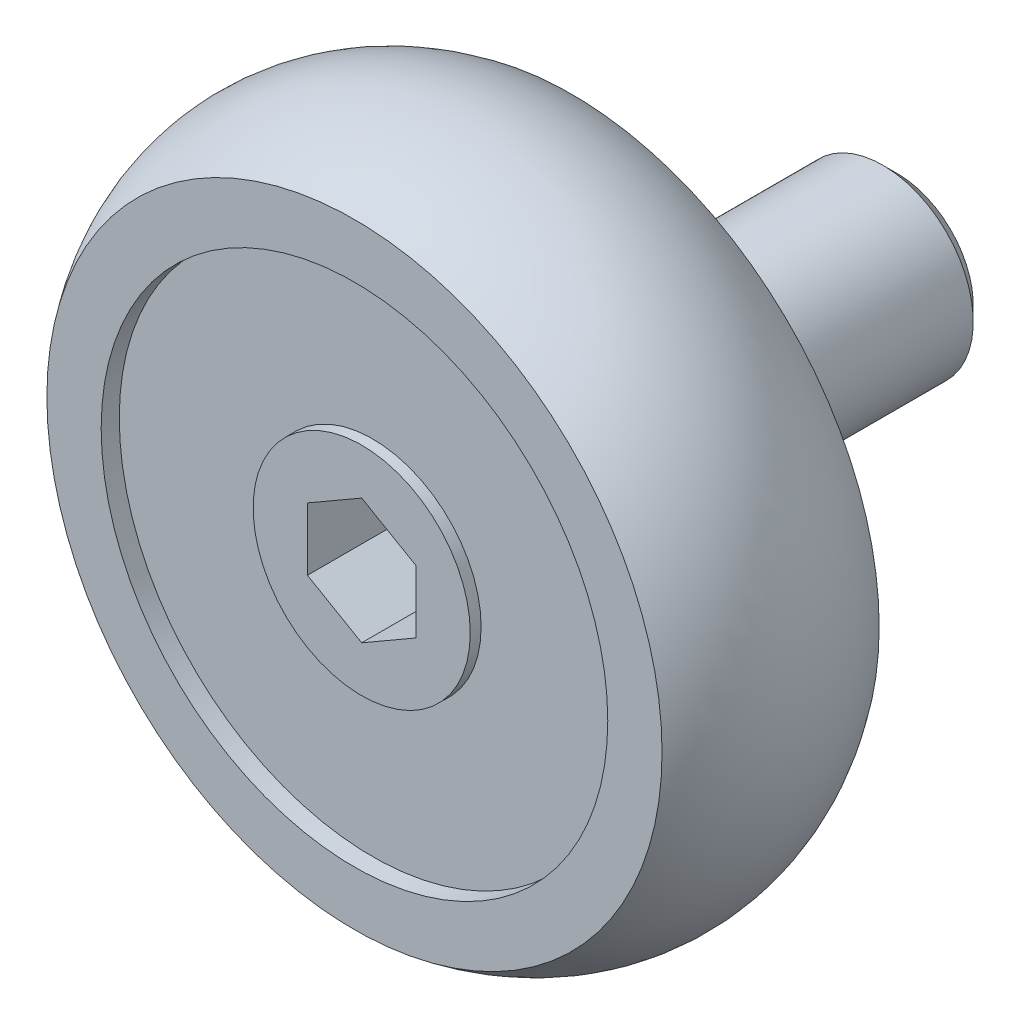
ISO-10303-21;
HEADER;
FILE_DESCRIPTION(('STEP AP214'),'2;1');
FILE_NAME('part.step','',(''),(''),'','','');
FILE_SCHEMA(('AUTOMOTIVE_DESIGN { 1 0 10303 214 1 1 1 1 }'));
ENDSEC;
DATA;
#1=APPLICATION_CONTEXT('core data for automotive mechanical design processes');
#2=APPLICATION_PROTOCOL_DEFINITION('international standard','automotive_design',2000,#1);
#3=PRODUCT_CONTEXT('',#1,'mechanical');
#4=PRODUCT('Part','Part','',(#3));
#5=PRODUCT_RELATED_PRODUCT_CATEGORY('part','',(#4));
#6=PRODUCT_DEFINITION_FORMATION('','',#4);
#7=PRODUCT_DEFINITION_CONTEXT('part definition',#1,'design');
#8=PRODUCT_DEFINITION('design','',#6,#7);
#9=PRODUCT_DEFINITION_SHAPE('','',#8);
#10=(LENGTH_UNIT() NAMED_UNIT(*) SI_UNIT(.MILLI.,.METRE.));
#11=(NAMED_UNIT(*) PLANE_ANGLE_UNIT() SI_UNIT($,.RADIAN.));
#12=(NAMED_UNIT(*) SI_UNIT($,.STERADIAN.) SOLID_ANGLE_UNIT());
#13=UNCERTAINTY_MEASURE_WITH_UNIT(LENGTH_MEASURE(1.E-05),#10,'distance_accuracy_value','');
#14=(GEOMETRIC_REPRESENTATION_CONTEXT(3) GLOBAL_UNCERTAINTY_ASSIGNED_CONTEXT((#13)) GLOBAL_UNIT_ASSIGNED_CONTEXT((#10,
#11,#12)) REPRESENTATION_CONTEXT('',''));
#15=CARTESIAN_POINT('',(0.,0.,0.));
#16=DIRECTION('',(0.,0.,1.));
#17=DIRECTION('',(1.,0.,0.));
#18=AXIS2_PLACEMENT_3D('',#15,#16,#17);
#19=CARTESIAN_POINT('',(0.,3.99999999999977,0.));
#20=DIRECTION('',(0.,0.,1.));
#21=DIRECTION('',(1.,0.,0.));
#22=AXIS2_PLACEMENT_3D('',#19,#20,#21);
#23=PLANE('',#22);
#24=CARTESIAN_POINT('',(0.,0.,0.));
#25=DIRECTION('',(0.,0.,1.));
#26=DIRECTION('',(1.,0.,0.));
#27=AXIS2_PLACEMENT_3D('',#24,#25,#26);
#28=CIRCLE('',#27,3.99999999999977);
#29=CARTESIAN_POINT('',(3.99999999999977,0.,0.));
#30=VERTEX_POINT('',#29);
#31=EDGE_CURVE('E9',#30,#30,#28,.T.);
#32=ORIENTED_EDGE('',*,*,#31,.F.);
#33=EDGE_LOOP('',(#32));
#34=FACE_BOUND('',#33,.T.);
#35=CARTESIAN_POINT('',(0.,0.,0.));
#36=DIRECTION('',(0.,0.,-1.));
#37=DIRECTION('',(-1.,0.,0.));
#38=AXIS2_PLACEMENT_3D('',#35,#36,#37);
#39=CIRCLE('',#38,2.);
#40=CARTESIAN_POINT('',(-2.,0.,0.));
#41=VERTEX_POINT('',#40);
#42=EDGE_CURVE('E104',#41,#41,#39,.T.);
#43=ORIENTED_EDGE('',*,*,#42,.F.);
#44=EDGE_LOOP('',(#43));
#45=FACE_BOUND('',#44,.T.);
#46=ADVANCED_FACE('F14',(#34,#45),#23,.F.);
#47=CARTESIAN_POINT('',(0.,0.,10.));
#48=DIRECTION('',(0.,0.,1.));
#49=DIRECTION('',(1.,0.,0.));
#50=AXIS2_PLACEMENT_3D('',#47,#48,#49);
#51=CYLINDRICAL_SURFACE('',#50,3.99999999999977);
#52=CARTESIAN_POINT('',(0.,0.,1.5));
#53=DIRECTION('',(0.,0.,1.));
#54=DIRECTION('',(1.,0.,0.));
#55=AXIS2_PLACEMENT_3D('',#52,#53,#54);
#56=CIRCLE('',#55,3.99999999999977);
#57=CARTESIAN_POINT('',(3.99999999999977,0.,1.5));
#58=VERTEX_POINT('',#57);
#59=EDGE_CURVE('E22',#58,#58,#56,.T.);
#60=ORIENTED_EDGE('',*,*,#59,.F.);
#61=EDGE_LOOP('',(#60));
#62=FACE_BOUND('',#61,.T.);
#63=ORIENTED_EDGE('',*,*,#31,.T.);
#64=EDGE_LOOP('',(#63));
#65=FACE_BOUND('',#64,.T.);
#66=ADVANCED_FACE('F150',(#62,#65),#51,.T.);
#67=CARTESIAN_POINT('',(0.,3.99999999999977,1.5));
#68=DIRECTION('',(0.,0.,1.));
#69=DIRECTION('',(1.,0.,0.));
#70=AXIS2_PLACEMENT_3D('',#67,#68,#69);
#71=PLANE('',#70);
#72=CARTESIAN_POINT('',(0.,0.,1.5));
#73=DIRECTION('',(0.,0.,1.));
#74=DIRECTION('',(1.,0.,0.));
#75=AXIS2_PLACEMENT_3D('',#72,#73,#74);
#76=CIRCLE('',#75,7.);
#77=CARTESIAN_POINT('',(7.,0.,1.5));
#78=VERTEX_POINT('',#77);
#79=EDGE_CURVE('E143',#78,#78,#76,.T.);
#80=ORIENTED_EDGE('',*,*,#79,.F.);
#81=EDGE_LOOP('',(#80));
#82=FACE_BOUND('',#81,.T.);
#83=ORIENTED_EDGE('',*,*,#59,.T.);
#84=EDGE_LOOP('',(#83));
#85=FACE_BOUND('',#84,.T.);
#86=ADVANCED_FACE('F148',(#82,#85),#71,.F.);
#87=CARTESIAN_POINT('',(0.,0.,10.));
#88=DIRECTION('',(0.,0.,1.));
#89=DIRECTION('',(1.,0.,0.));
#90=AXIS2_PLACEMENT_3D('',#87,#88,#89);
#91=CYLINDRICAL_SURFACE('',#90,7.);
#92=CARTESIAN_POINT('',(0.,0.,1.));
#93=DIRECTION('',(0.,0.,1.));
#94=DIRECTION('',(1.,0.,0.));
#95=AXIS2_PLACEMENT_3D('',#92,#93,#94);
#96=CIRCLE('',#95,7.);
#97=CARTESIAN_POINT('',(7.,0.,1.));
#98=VERTEX_POINT('',#97);
#99=EDGE_CURVE('E140',#98,#98,#96,.T.);
#100=ORIENTED_EDGE('',*,*,#99,.F.);
#101=EDGE_LOOP('',(#100));
#102=FACE_BOUND('',#101,.T.);
#103=ORIENTED_EDGE('',*,*,#79,.T.);
#104=EDGE_LOOP('',(#103));
#105=FACE_BOUND('',#104,.T.);
#106=ADVANCED_FACE('F223',(#102,#105),#91,.F.);
#107=CARTESIAN_POINT('',(0.,8.5,1.));
#108=DIRECTION('',(0.,0.,1.));
#109=DIRECTION('',(1.,0.,0.));
#110=AXIS2_PLACEMENT_3D('',#107,#108,#109);
#111=PLANE('',#110);
#112=CARTESIAN_POINT('',(0.,0.,1.));
#113=DIRECTION('',(0.,0.,1.));
#114=DIRECTION('',(1.,0.,0.));
#115=AXIS2_PLACEMENT_3D('',#112,#113,#114);
#116=CIRCLE('',#115,8.5);
#117=CARTESIAN_POINT('',(8.5,0.,1.));
#118=VERTEX_POINT('',#117);
#119=EDGE_CURVE('E137',#118,#118,#116,.T.);
#120=ORIENTED_EDGE('',*,*,#119,.F.);
#121=EDGE_LOOP('',(#120));
#122=FACE_BOUND('',#121,.T.);
#123=ORIENTED_EDGE('',*,*,#99,.T.);
#124=EDGE_LOOP('',(#123));
#125=FACE_BOUND('',#124,.T.);
#126=ADVANCED_FACE('F219',(#122,#125),#111,.F.);
#127=CARTESIAN_POINT('',(0.,0.,4.));
#128=DIRECTION('',(0.,0.,1.));
#129=DIRECTION('',(1.,0.,0.));
#130=AXIS2_PLACEMENT_3D('',#127,#128,#129);
#131=DEGENERATE_TOROIDAL_SURFACE('',#130,4.5,5.,.T.);
#132=CARTESIAN_POINT('',(0.,0.,7.));
#133=DIRECTION('',(0.,0.,1.));
#134=DIRECTION('',(1.,0.,0.));
#135=AXIS2_PLACEMENT_3D('',#132,#133,#134);
#136=CIRCLE('',#135,8.5);
#137=CARTESIAN_POINT('',(8.5,0.,7.));
#138=VERTEX_POINT('',#137);
#139=EDGE_CURVE('E134',#138,#138,#136,.T.);
#140=ORIENTED_EDGE('',*,*,#139,.F.);
#141=EDGE_LOOP('',(#140));
#142=FACE_BOUND('',#141,.T.);
#143=ORIENTED_EDGE('',*,*,#119,.T.);
#144=EDGE_LOOP('',(#143));
#145=FACE_BOUND('',#144,.T.);
#146=ADVANCED_FACE('F215',(#142,#145),#131,.T.);
#147=CARTESIAN_POINT('',(0.,8.5,7.));
#148=DIRECTION('',(0.,0.,-1.));
#149=DIRECTION('',(-1.,0.,0.));
#150=AXIS2_PLACEMENT_3D('',#147,#148,#149);
#151=PLANE('',#150);
#152=CARTESIAN_POINT('',(0.,0.,7.));
#153=DIRECTION('',(0.,0.,1.));
#154=DIRECTION('',(1.,0.,0.));
#155=AXIS2_PLACEMENT_3D('',#152,#153,#154);
#156=CIRCLE('',#155,7.);
#157=CARTESIAN_POINT('',(7.,0.,7.));
#158=VERTEX_POINT('',#157);
#159=EDGE_CURVE('E131',#158,#158,#156,.T.);
#160=ORIENTED_EDGE('',*,*,#159,.F.);
#161=EDGE_LOOP('',(#160));
#162=FACE_BOUND('',#161,.T.);
#163=ORIENTED_EDGE('',*,*,#139,.T.);
#164=EDGE_LOOP('',(#163));
#165=FACE_BOUND('',#164,.T.);
#166=ADVANCED_FACE('F211',(#162,#165),#151,.F.);
#167=CARTESIAN_POINT('',(0.,0.,10.));
#168=DIRECTION('',(0.,0.,1.));
#169=DIRECTION('',(1.,0.,0.));
#170=AXIS2_PLACEMENT_3D('',#167,#168,#169);
#171=CYLINDRICAL_SURFACE('',#170,7.);
#172=CARTESIAN_POINT('',(0.,0.,6.5));
#173=DIRECTION('',(0.,0.,1.));
#174=DIRECTION('',(1.,0.,0.));
#175=AXIS2_PLACEMENT_3D('',#172,#173,#174);
#176=CIRCLE('',#175,7.);
#177=CARTESIAN_POINT('',(7.,0.,6.5));
#178=VERTEX_POINT('',#177);
#179=EDGE_CURVE('E128',#178,#178,#176,.T.);
#180=ORIENTED_EDGE('',*,*,#179,.F.);
#181=EDGE_LOOP('',(#180));
#182=FACE_BOUND('',#181,.T.);
#183=ORIENTED_EDGE('',*,*,#159,.T.);
#184=EDGE_LOOP('',(#183));
#185=FACE_BOUND('',#184,.T.);
#186=ADVANCED_FACE('F207',(#182,#185),#171,.F.);
#187=CARTESIAN_POINT('',(0.,3.,6.5));
#188=DIRECTION('',(0.,0.,-1.));
#189=DIRECTION('',(-1.,0.,0.));
#190=AXIS2_PLACEMENT_3D('',#187,#188,#189);
#191=PLANE('',#190);
#192=CARTESIAN_POINT('',(0.,0.,6.5));
#193=DIRECTION('',(0.,0.,1.));
#194=DIRECTION('',(1.,0.,0.));
#195=AXIS2_PLACEMENT_3D('',#192,#193,#194);
#196=CIRCLE('',#195,3.);
#197=CARTESIAN_POINT('',(3.,0.,6.5));
#198=VERTEX_POINT('',#197);
#199=EDGE_CURVE('E125',#198,#198,#196,.T.);
#200=ORIENTED_EDGE('',*,*,#199,.F.);
#201=EDGE_LOOP('',(#200));
#202=FACE_BOUND('',#201,.T.);
#203=ORIENTED_EDGE('',*,*,#179,.T.);
#204=EDGE_LOOP('',(#203));
#205=FACE_BOUND('',#204,.T.);
#206=ADVANCED_FACE('F203',(#202,#205),#191,.F.);
#207=CARTESIAN_POINT('',(0.,0.,10.));
#208=DIRECTION('',(0.,0.,1.));
#209=DIRECTION('',(1.,0.,0.));
#210=AXIS2_PLACEMENT_3D('',#207,#208,#209);
#211=CYLINDRICAL_SURFACE('',#210,3.);
#212=CARTESIAN_POINT('',(0.,0.,6.8));
#213=DIRECTION('',(0.,0.,1.));
#214=DIRECTION('',(1.,0.,0.));
#215=AXIS2_PLACEMENT_3D('',#212,#213,#214);
#216=CIRCLE('',#215,3.);
#217=CARTESIAN_POINT('',(3.,0.,6.8));
#218=VERTEX_POINT('',#217);
#219=EDGE_CURVE('E117',#218,#218,#216,.T.);
#220=ORIENTED_EDGE('',*,*,#219,.F.);
#221=EDGE_LOOP('',(#220));
#222=FACE_BOUND('',#221,.T.);
#223=ORIENTED_EDGE('',*,*,#199,.T.);
#224=EDGE_LOOP('',(#223));
#225=FACE_BOUND('',#224,.T.);
#226=ADVANCED_FACE('F200',(#222,#225),#211,.T.);
#227=CARTESIAN_POINT('',(0.,3.,6.8));
#228=DIRECTION('',(0.,0.,-1.));
#229=DIRECTION('',(-1.,0.,0.));
#230=AXIS2_PLACEMENT_3D('',#227,#228,#229);
#231=PLANE('',#230);
#232=DIRECTION('',(-0.866025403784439,-0.5,0.));
#233=VECTOR('',#232,1.);
#234=CARTESIAN_POINT('',(0.,1.73205080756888,6.8));
#235=LINE('',#234,#233);
#236=CARTESIAN_POINT('',(0.,1.73205080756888,6.8));
#237=VERTEX_POINT('',#236);
#238=CARTESIAN_POINT('',(-1.5,0.866025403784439,6.8));
#239=VERTEX_POINT('',#238);
#240=EDGE_CURVE('E103',#237,#239,#235,.T.);
#241=ORIENTED_EDGE('',*,*,#240,.F.);
#242=DIRECTION('',(-0.866025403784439,0.5,0.));
#243=VECTOR('',#242,1.);
#244=CARTESIAN_POINT('',(1.5,0.86602540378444,6.8));
#245=LINE('',#244,#243);
#246=CARTESIAN_POINT('',(1.5,0.86602540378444,6.8));
#247=VERTEX_POINT('',#246);
#248=EDGE_CURVE('E29',#247,#237,#245,.T.);
#249=ORIENTED_EDGE('',*,*,#248,.F.);
#250=DIRECTION('',(0.,1.,0.));
#251=VECTOR('',#250,1.);
#252=CARTESIAN_POINT('',(1.5,-0.866025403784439,6.8));
#253=LINE('',#252,#251);
#254=CARTESIAN_POINT('',(1.5,-0.866025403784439,6.8));
#255=VERTEX_POINT('',#254);
#256=EDGE_CURVE('E113',#255,#247,#253,.T.);
#257=ORIENTED_EDGE('',*,*,#256,.F.);
#258=DIRECTION('',(0.866025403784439,0.5,0.));
#259=VECTOR('',#258,1.);
#260=CARTESIAN_POINT('',(0.,-1.73205080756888,6.8));
#261=LINE('',#260,#259);
#262=CARTESIAN_POINT('',(0.,-1.73205080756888,6.8));
#263=VERTEX_POINT('',#262);
#264=EDGE_CURVE('E111',#263,#255,#261,.T.);
#265=ORIENTED_EDGE('',*,*,#264,.F.);
#266=DIRECTION('',(0.866025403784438,-0.5,0.));
#267=VECTOR('',#266,1.);
#268=CARTESIAN_POINT('',(-1.5,-0.866025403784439,6.8));
#269=LINE('',#268,#267);
#270=CARTESIAN_POINT('',(-1.5,-0.866025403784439,6.8));
#271=VERTEX_POINT('',#270);
#272=EDGE_CURVE('E77',#271,#263,#269,.T.);
#273=ORIENTED_EDGE('',*,*,#272,.F.);
#274=DIRECTION('',(0.,-1.,0.));
#275=VECTOR('',#274,1.);
#276=CARTESIAN_POINT('',(-1.5,0.866025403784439,6.8));
#277=LINE('',#276,#275);
#278=EDGE_CURVE('E107',#239,#271,#277,.T.);
#279=ORIENTED_EDGE('',*,*,#278,.F.);
#280=EDGE_LOOP('',(#241,#249,#257,#265,#273,#279));
#281=FACE_BOUND('',#280,.T.);
#282=ORIENTED_EDGE('',*,*,#219,.T.);
#283=EDGE_LOOP('',(#282));
#284=FACE_BOUND('',#283,.T.);
#285=ADVANCED_FACE('F175',(#281,#284),#231,.F.);
#286=CARTESIAN_POINT('',(1.5,0.86602540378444,4.3));
#287=DIRECTION('',(0.5,0.866025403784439,0.));
#288=DIRECTION('',(-0.866025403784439,0.5,0.));
#289=AXIS2_PLACEMENT_3D('',#286,#287,#288);
#290=PLANE('',#289);
#291=ORIENTED_EDGE('',*,*,#248,.T.);
#292=DIRECTION('',(0.,0.,1.));
#293=VECTOR('',#292,1.);
#294=CARTESIAN_POINT('',(0.,1.73205080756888,4.3));
#295=LINE('',#294,#293);
#296=CARTESIAN_POINT('',(0.,1.73205080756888,4.3));
#297=VERTEX_POINT('',#296);
#298=EDGE_CURVE('E59',#297,#237,#295,.T.);
#299=ORIENTED_EDGE('',*,*,#298,.F.);
#300=DIRECTION('',(-0.866025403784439,0.5,0.));
#301=VECTOR('',#300,1.);
#302=CARTESIAN_POINT('',(1.5,0.86602540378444,4.3));
#303=LINE('',#302,#301);
#304=CARTESIAN_POINT('',(1.5,0.86602540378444,4.3));
#305=VERTEX_POINT('',#304);
#306=EDGE_CURVE('E115',#305,#297,#303,.T.);
#307=ORIENTED_EDGE('',*,*,#306,.F.);
#308=DIRECTION('',(0.,0.,1.));
#309=VECTOR('',#308,1.);
#310=CARTESIAN_POINT('',(1.5,0.86602540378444,4.3));
#311=LINE('',#310,#309);
#312=EDGE_CURVE('E37',#305,#247,#311,.T.);
#313=ORIENTED_EDGE('',*,*,#312,.T.);
#314=EDGE_LOOP('',(#291,#299,#307,#313));
#315=FACE_BOUND('',#314,.T.);
#316=ADVANCED_FACE('F180',(#315),#290,.F.);
#317=CARTESIAN_POINT('',(1.5,-0.866025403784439,4.3));
#318=DIRECTION('',(1.,0.,0.));
#319=DIRECTION('',(0.,0.,-1.));
#320=AXIS2_PLACEMENT_3D('',#317,#318,#319);
#321=PLANE('',#320);
#322=ORIENTED_EDGE('',*,*,#256,.T.);
#323=ORIENTED_EDGE('',*,*,#312,.F.);
#324=DIRECTION('',(0.,1.,0.));
#325=VECTOR('',#324,1.);
#326=CARTESIAN_POINT('',(1.5,-0.866025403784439,4.3));
#327=LINE('',#326,#325);
#328=CARTESIAN_POINT('',(1.5,-0.866025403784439,4.3));
#329=VERTEX_POINT('',#328);
#330=EDGE_CURVE('E89',#329,#305,#327,.T.);
#331=ORIENTED_EDGE('',*,*,#330,.F.);
#332=DIRECTION('',(0.,0.,1.));
#333=VECTOR('',#332,1.);
#334=CARTESIAN_POINT('',(1.5,-0.866025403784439,4.3));
#335=LINE('',#334,#333);
#336=EDGE_CURVE('E81',#329,#255,#335,.T.);
#337=ORIENTED_EDGE('',*,*,#336,.T.);
#338=EDGE_LOOP('',(#322,#323,#331,#337));
#339=FACE_BOUND('',#338,.T.);
#340=ADVANCED_FACE('F178',(#339),#321,.F.);
#341=CARTESIAN_POINT('',(0.,-1.73205080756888,4.3));
#342=DIRECTION('',(0.5,-0.866025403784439,0.));
#343=DIRECTION('',(0.866025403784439,0.5,0.));
#344=AXIS2_PLACEMENT_3D('',#341,#342,#343);
#345=PLANE('',#344);
#346=ORIENTED_EDGE('',*,*,#264,.T.);
#347=ORIENTED_EDGE('',*,*,#336,.F.);
#348=DIRECTION('',(0.866025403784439,0.5,0.));
#349=VECTOR('',#348,1.);
#350=CARTESIAN_POINT('',(0.,-1.73205080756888,4.3));
#351=LINE('',#350,#349);
#352=CARTESIAN_POINT('',(0.,-1.73205080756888,4.3));
#353=VERTEX_POINT('',#352);
#354=EDGE_CURVE('E85',#353,#329,#351,.T.);
#355=ORIENTED_EDGE('',*,*,#354,.F.);
#356=DIRECTION('',(0.,0.,1.));
#357=VECTOR('',#356,1.);
#358=CARTESIAN_POINT('',(0.,-1.73205080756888,4.3));
#359=LINE('',#358,#357);
#360=EDGE_CURVE('E70',#353,#263,#359,.T.);
#361=ORIENTED_EDGE('',*,*,#360,.T.);
#362=EDGE_LOOP('',(#346,#347,#355,#361));
#363=FACE_BOUND('',#362,.T.);
#364=ADVANCED_FACE('F86',(#363),#345,.F.);
#365=CARTESIAN_POINT('',(-1.5,-0.866025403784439,4.3));
#366=DIRECTION('',(-0.5,-0.866025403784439,0.));
#367=DIRECTION('',(0.866025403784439,-0.5,0.));
#368=AXIS2_PLACEMENT_3D('',#365,#366,#367);
#369=PLANE('',#368);
#370=ORIENTED_EDGE('',*,*,#272,.T.);
#371=ORIENTED_EDGE('',*,*,#360,.F.);
#372=DIRECTION('',(0.866025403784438,-0.5,0.));
#373=VECTOR('',#372,1.);
#374=CARTESIAN_POINT('',(-1.5,-0.866025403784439,4.3));
#375=LINE('',#374,#373);
#376=CARTESIAN_POINT('',(-1.5,-0.866025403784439,4.3));
#377=VERTEX_POINT('',#376);
#378=EDGE_CURVE('E74',#377,#353,#375,.T.);
#379=ORIENTED_EDGE('',*,*,#378,.F.);
#380=DIRECTION('',(0.,0.,1.));
#381=VECTOR('',#380,1.);
#382=CARTESIAN_POINT('',(-1.5,-0.866025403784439,4.3));
#383=LINE('',#382,#381);
#384=EDGE_CURVE('E82',#377,#271,#383,.T.);
#385=ORIENTED_EDGE('',*,*,#384,.T.);
#386=EDGE_LOOP('',(#370,#371,#379,#385));
#387=FACE_BOUND('',#386,.T.);
#388=ADVANCED_FACE('F72',(#387),#369,.F.);
#389=CARTESIAN_POINT('',(-1.5,0.866025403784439,4.3));
#390=DIRECTION('',(-1.,0.,0.));
#391=DIRECTION('',(0.,-1.,0.));
#392=AXIS2_PLACEMENT_3D('',#389,#390,#391);
#393=PLANE('',#392);
#394=ORIENTED_EDGE('',*,*,#278,.T.);
#395=ORIENTED_EDGE('',*,*,#384,.F.);
#396=DIRECTION('',(0.,-1.,0.));
#397=VECTOR('',#396,1.);
#398=CARTESIAN_POINT('',(-1.5,0.866025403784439,4.3));
#399=LINE('',#398,#397);
#400=CARTESIAN_POINT('',(-1.5,0.866025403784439,4.3));
#401=VERTEX_POINT('',#400);
#402=EDGE_CURVE('E95',#401,#377,#399,.T.);
#403=ORIENTED_EDGE('',*,*,#402,.F.);
#404=DIRECTION('',(0.,0.,1.));
#405=VECTOR('',#404,1.);
#406=CARTESIAN_POINT('',(-1.5,0.866025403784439,4.3));
#407=LINE('',#406,#405);
#408=EDGE_CURVE('E120',#401,#239,#407,.T.);
#409=ORIENTED_EDGE('',*,*,#408,.T.);
#410=EDGE_LOOP('',(#394,#395,#403,#409));
#411=FACE_BOUND('',#410,.T.);
#412=ADVANCED_FACE('F173',(#411),#393,.F.);
#413=CARTESIAN_POINT('',(0.,1.73205080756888,4.3));
#414=DIRECTION('',(-0.5,0.866025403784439,0.));
#415=DIRECTION('',(-0.866025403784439,-0.5,0.));
#416=AXIS2_PLACEMENT_3D('',#413,#414,#415);
#417=PLANE('',#416);
#418=ORIENTED_EDGE('',*,*,#240,.T.);
#419=ORIENTED_EDGE('',*,*,#408,.F.);
#420=DIRECTION('',(-0.866025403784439,-0.5,0.));
#421=VECTOR('',#420,1.);
#422=CARTESIAN_POINT('',(0.,1.73205080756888,4.3));
#423=LINE('',#422,#421);
#424=EDGE_CURVE('E97',#297,#401,#423,.T.);
#425=ORIENTED_EDGE('',*,*,#424,.F.);
#426=ORIENTED_EDGE('',*,*,#298,.T.);
#427=EDGE_LOOP('',(#418,#419,#425,#426));
#428=FACE_BOUND('',#427,.T.);
#429=ADVANCED_FACE('F169',(#428),#417,.F.);
#430=CARTESIAN_POINT('',(0.,0.,4.3));
#431=DIRECTION('',(0.,0.,1.));
#432=DIRECTION('',(1.,0.,0.));
#433=AXIS2_PLACEMENT_3D('',#430,#431,#432);
#434=PLANE('',#433);
#435=ORIENTED_EDGE('',*,*,#306,.T.);
#436=ORIENTED_EDGE('',*,*,#424,.T.);
#437=ORIENTED_EDGE('',*,*,#402,.T.);
#438=ORIENTED_EDGE('',*,*,#378,.T.);
#439=ORIENTED_EDGE('',*,*,#354,.T.);
#440=ORIENTED_EDGE('',*,*,#330,.T.);
#441=EDGE_LOOP('',(#435,#436,#437,#438,#439,#440));
#442=FACE_BOUND('',#441,.T.);
#443=ADVANCED_FACE('F92',(#442),#434,.T.);
#444=CARTESIAN_POINT('',(0.,0.,-8.));
#445=DIRECTION('',(0.,0.,-1.));
#446=DIRECTION('',(-1.,0.,0.));
#447=AXIS2_PLACEMENT_3D('',#444,#445,#446);
#448=CYLINDRICAL_SURFACE('',#447,2.);
#449=CARTESIAN_POINT('',(0.,0.,-1.6));
#450=DIRECTION('',(0.,0.,-1.));
#451=DIRECTION('',(-1.,0.,0.));
#452=AXIS2_PLACEMENT_3D('',#449,#450,#451);
#453=CIRCLE('',#452,2.);
#454=CARTESIAN_POINT('',(-2.,0.,-1.6));
#455=VERTEX_POINT('',#454);
#456=EDGE_CURVE('E161',#455,#455,#453,.T.);
#457=ORIENTED_EDGE('',*,*,#456,.F.);
#458=EDGE_LOOP('',(#457));
#459=FACE_BOUND('',#458,.T.);
#460=ORIENTED_EDGE('',*,*,#42,.T.);
#461=EDGE_LOOP('',(#460));
#462=FACE_BOUND('',#461,.T.);
#463=ADVANCED_FACE('F325',(#459,#462),#448,.T.);
#464=CARTESIAN_POINT('',(0.,2.,-1.6));
#465=DIRECTION('',(0.,0.,-1.));
#466=DIRECTION('',(-1.,0.,0.));
#467=AXIS2_PLACEMENT_3D('',#464,#465,#466);
#468=PLANE('',#467);
#469=CARTESIAN_POINT('',(0.,0.,-1.6));
#470=DIRECTION('',(0.,0.,-1.));
#471=DIRECTION('',(-1.,0.,0.));
#472=AXIS2_PLACEMENT_3D('',#469,#470,#471);
#473=CIRCLE('',#472,2.5);
#474=CARTESIAN_POINT('',(-2.5,0.,-1.6));
#475=VERTEX_POINT('',#474);
#476=EDGE_CURVE('E164',#475,#475,#473,.T.);
#477=ORIENTED_EDGE('',*,*,#476,.F.);
#478=EDGE_LOOP('',(#477));
#479=FACE_BOUND('',#478,.T.);
#480=ORIENTED_EDGE('',*,*,#456,.T.);
#481=EDGE_LOOP('',(#480));
#482=FACE_BOUND('',#481,.T.);
#483=ADVANCED_FACE('F334',(#479,#482),#468,.F.);
#484=CARTESIAN_POINT('',(0.,0.,-8.));
#485=DIRECTION('',(0.,0.,-1.));
#486=DIRECTION('',(-1.,0.,0.));
#487=AXIS2_PLACEMENT_3D('',#484,#485,#486);
#488=CYLINDRICAL_SURFACE('',#487,2.5);
#489=CARTESIAN_POINT('',(0.,0.,-7.6));
#490=DIRECTION('',(0.,0.,-1.));
#491=DIRECTION('',(-1.,0.,0.));
#492=AXIS2_PLACEMENT_3D('',#489,#490,#491);
#493=CIRCLE('',#492,2.5);
#494=CARTESIAN_POINT('',(-2.5,0.,-7.6));
#495=VERTEX_POINT('',#494);
#496=EDGE_CURVE('E378',#495,#495,#493,.T.);
#497=ORIENTED_EDGE('',*,*,#496,.F.);
#498=EDGE_LOOP('',(#497));
#499=FACE_BOUND('',#498,.T.);
#500=ORIENTED_EDGE('',*,*,#476,.T.);
#501=EDGE_LOOP('',(#500));
#502=FACE_BOUND('',#501,.T.);
#503=ADVANCED_FACE('F343',(#499,#502),#488,.T.);
#504=CARTESIAN_POINT('',(0.,0.,-7.6));
#505=DIRECTION('',(0.,0.,1.));
#506=DIRECTION('',(1.,0.,0.));
#507=AXIS2_PLACEMENT_3D('',#504,#505,#506);
#508=CONICAL_SURFACE('',#507,2.5,0.785398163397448);
#509=CARTESIAN_POINT('',(0.,0.,-8.));
#510=DIRECTION('',(0.,0.,-1.));
#511=DIRECTION('',(-1.,0.,0.));
#512=AXIS2_PLACEMENT_3D('',#509,#510,#511);
#513=CIRCLE('',#512,2.1);
#514=CARTESIAN_POINT('',(-2.1,0.,-8.));
#515=VERTEX_POINT('',#514);
#516=EDGE_CURVE('E377',#515,#515,#513,.T.);
#517=ORIENTED_EDGE('',*,*,#516,.F.);
#518=EDGE_LOOP('',(#517));
#519=FACE_BOUND('',#518,.T.);
#520=ORIENTED_EDGE('',*,*,#496,.T.);
#521=EDGE_LOOP('',(#520));
#522=FACE_BOUND('',#521,.T.);
#523=ADVANCED_FACE('F353',(#519,#522),#508,.T.);
#524=CARTESIAN_POINT('',(0.,0.,-8.));
#525=DIRECTION('',(0.,0.,1.));
#526=DIRECTION('',(1.,0.,0.));
#527=AXIS2_PLACEMENT_3D('',#524,#525,#526);
#528=PLANE('',#527);
#529=ORIENTED_EDGE('',*,*,#516,.T.);
#530=EDGE_LOOP('',(#529));
#531=FACE_BOUND('',#530,.T.);
#532=ADVANCED_FACE('F16',(#531),#528,.F.);
#533=CLOSED_SHELL('',(#46,#66,#86,#106,#126,#146,#166,#186,#206,#226,#285,#316,#340,#364,#388,
#412,#429,#443,#463,#483,#503,#523,#532));
#534=MANIFOLD_SOLID_BREP('B1',#533);
#535=ADVANCED_BREP_SHAPE_REPRESENTATION('',(#18,#534),#14);
#536=SHAPE_DEFINITION_REPRESENTATION(#9,#535);
ENDSEC;
END-ISO-10303-21;
